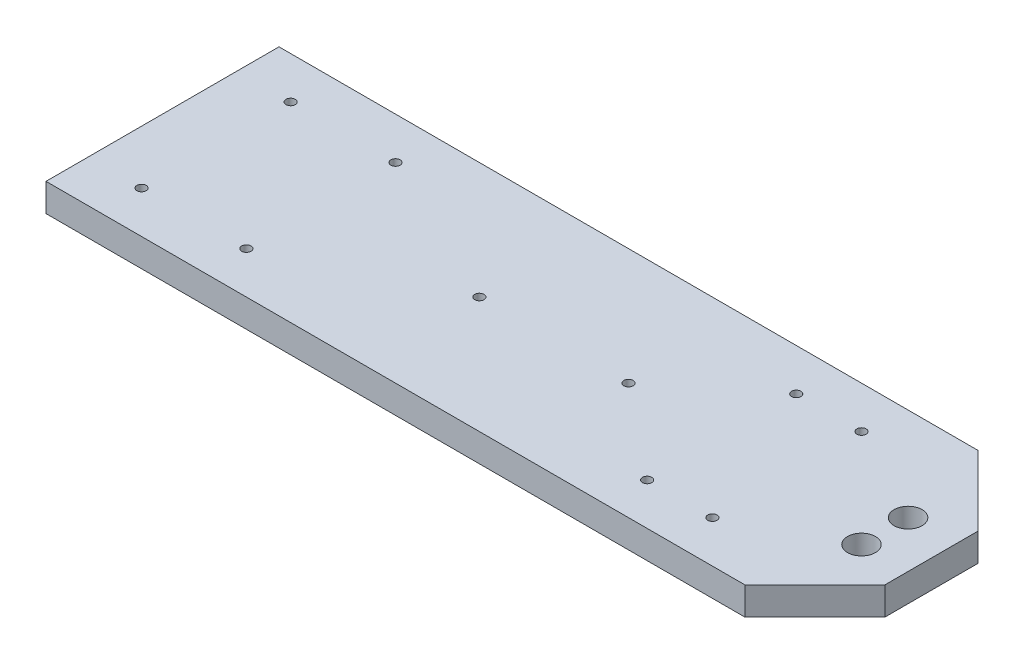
from build123d import *

# Parameters (mm, degrees)
ESQUISSE1_W             = 165
ESQUISSE1_H             = 50
EXTRUSION1_DEPTH        = 6
CHANFREIN1_SIZE         = 15
ESQUISSE2_R             = 1
ENL_V_MAT_EXTRU_1_DEPTH = 173.513767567
ESQUISSE3_R             = 3
ENL_V_MAT_EXTRU_2_DEPTH = 173.513767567


with BuildPart() as part:
    # Esquisse1 → Extrusion1 (new body)
    with BuildSketch(Plane(origin=(0, 0, 0), x_dir=(1, 0, 0), z_dir=(0, 1, 0))):
        with Locations((82.5, 25)):
            Rectangle(ESQUISSE1_W, ESQUISSE1_H)
    extrude(amount=EXTRUSION1_DEPTH)

    # Chanfrein1
    chanfrein1_edges = [part.edges().sort_by_distance(p)[0] for p in [
        (165, 3, -50),
        (165, 3, 0),
    ]]
    chamfer(chanfrein1_edges, length=CHANFREIN1_SIZE)

    # Esquisse2 → Enl_v. mat.-Extru.1 (cut, through all)
    with BuildSketch(Plane(origin=(0, 6, 0), x_dir=(-1, 0, 0), z_dir=(0, 1, 0))):
        with Locations(Location((-134, -41, 0), (0, 0, 90))):
            Circle(ESQUISSE2_R)
        with Locations(Location((-120, -41, 0), (0, 0, 90))):
            Circle(ESQUISSE2_R)
        with Locations(Location((-34, -41, 0), (0, 0, 90))):
            Circle(ESQUISSE2_R)
        with Locations(Location((-11.5, -41, 0), (0, 0, 90))):
            Circle(ESQUISSE2_R)
        with Locations(Location((-11.5, -9, 0), (0, 0, 270))):
            Circle(ESQUISSE2_R)
        with Locations(Location((-34, -9, 0), (0, 0, 270))):
            Circle(ESQUISSE2_R)
        with Locations(Location((-120, -9, 0), (0, 0, 270))):
            Circle(ESQUISSE2_R)
        with Locations(Location((-134, -9, 0), (0, 0, 270))):
            Circle(ESQUISSE2_R)
        with Locations(Location((-100, -25, 0), (0, 0, 90))):
            Circle(ESQUISSE2_R)
        with Locations(Location((-68, -25, 0), (0, 0, 90))):
            Circle(ESQUISSE2_R)
    extrude(amount=-ENL_V_MAT_EXTRU_1_DEPTH, mode=Mode.SUBTRACT)

    # Esquisse3 → Enl_v. mat.-Extru.2 (cut, through all)
    with BuildSketch(Plane(origin=(0, 6, 0), x_dir=(-1, 0, 0), z_dir=(0, 1, 0))):
        with Locations(Location((-155, -30, 0), (0, 0, 90))):
            Circle(ESQUISSE3_R)
        with Locations(Location((-155, -20, 0), (0, 0, 270))):
            Circle(ESQUISSE3_R)
    extrude(amount=-ENL_V_MAT_EXTRU_2_DEPTH, mode=Mode.SUBTRACT)


solid = part.part
